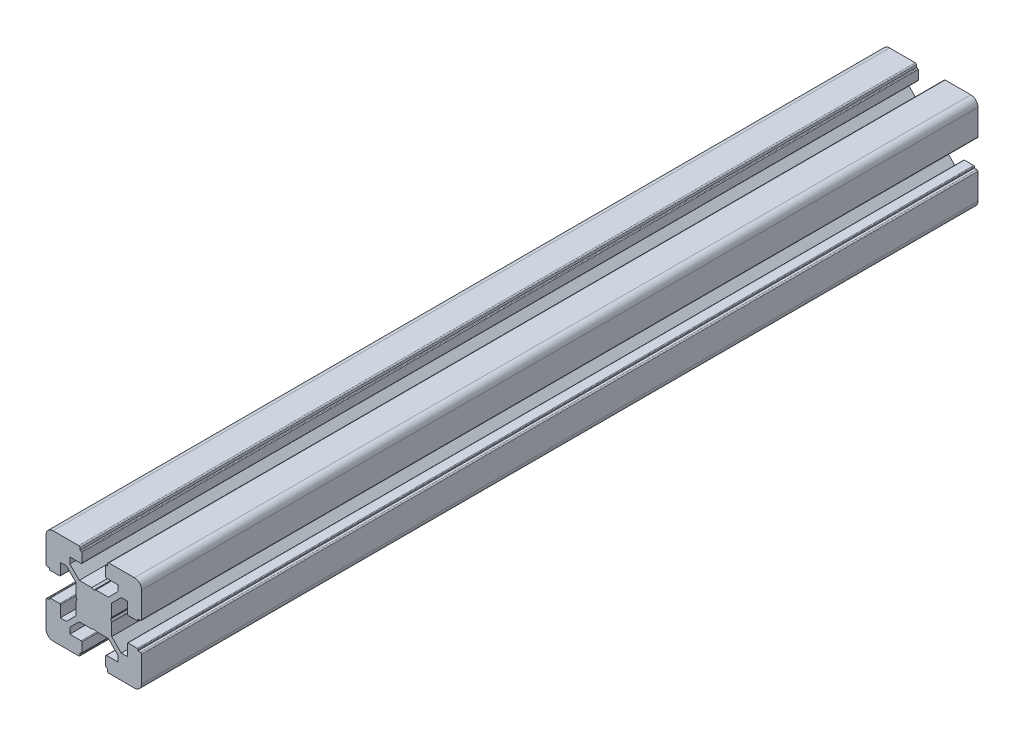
from build123d import *

# Parameters (mm, degrees)
BOSS_EXTRUDE1_DEPTH = 350


with BuildPart() as part:
    # Sketch2 → Boss-Extrude1 (new body)
    with BuildSketch(Plane.XY):
        with BuildLine():
            Line((-20.29996667, 9.949913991), (-20.29996667, 14.70003333))
            ThreePointArc((-20.29996667, 14.70003333), (-20.387834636, 14.912165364), (-20.59996667, 15.00003333))
            Line((-20.59996667, 15.00003333), (-24.49996667, 15.00003333))
            ThreePointArc((-24.49996667, 15.00003333), (-24.712098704, 14.912165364), (-24.79996667, 14.70003333))
            Line((-24.79996667, 14.70003333), (-24.79996667, 14.20003333))
            Line((-24.79996667, 14.20003333), (-25.79996667, 14.20003333))
            ThreePointArc((-25.79996667, 14.20003333), (-26.153520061, 14.053586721), (-26.29996667, 13.70003333))
            Line((-26.29996667, 13.70003333), (-26.29996667, 3))
            ThreePointArc((-26.29996667, 3), (-25.421287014, 0.878679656), (-23.29996667, 0))
            Line((-23.29996667, 0), (-12.6, 0))
            ThreePointArc((-12.6, 0), (-12.246446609, 0.146446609), (-12.1, 0.5))
            Line((-12.1, 0.5), (-12.1, 1.5))
            Line((-12.1, 1.5), (-11.6, 1.5))
            ThreePointArc((-11.6, 1.5), (-11.387867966, 1.587867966), (-11.3, 1.8))
            Line((-11.3, 1.8), (-11.3, 5.7))
            ThreePointArc((-11.3, 5.7), (-11.387867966, 5.912132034), (-11.6, 6))
            Line((-11.6, 6), (-16.350119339, 6))
            Line((-16.350119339, 6), (-16.350119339, 8.535633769))
            Line((-16.350119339, 8.535633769), (-12.385643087, 12.500110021))
            Line((-12.385643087, 12.500110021), (-7.165992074, 12.500110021))
            Line((-7.165992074, 12.500110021), (-6.29996667, 13.000110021))
            Line((-6.29996667, 13.000110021), (-5.433941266, 12.500110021))
            Line((-5.433941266, 12.500110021), (-0.214290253, 12.500110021))
            Line((-0.214290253, 12.500110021), (3.750119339, 8.535700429))
            Line((3.750119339, 8.535700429), (3.750119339, 6))
            Line((3.750119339, 6), (-1, 6))
            ThreePointArc((-1, 6), (-1.212132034, 5.912132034), (-1.3, 5.7))
            Line((-1.3, 5.7), (-1.3, 1.8))
            ThreePointArc((-1.3, 1.8), (-1.212132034, 1.587867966), (-1, 1.5))
            Line((-1, 1.5), (-0.5, 1.5))
            Line((-0.5, 1.5), (-0.5, 0.5))
            ThreePointArc((-0.5, 0.5), (-0.353553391, 0.146446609), (0, 0))
            Line((0, 0), (10.70003333, 0))
            ThreePointArc((10.70003333, 0), (12.821353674, 0.878679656), (13.70003333, 3))
            Line((13.70003333, 3), (13.70003333, 13.69996667))
            ThreePointArc((13.70003333, 13.69996667), (13.553586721, 14.053520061), (13.20003333, 14.19996667))
            Line((13.20003333, 14.19996667), (12.20003333, 14.19996667))
            Line((12.20003333, 14.19996667), (12.20003333, 14.69996667))
            ThreePointArc((12.20003333, 14.69996667), (12.112165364, 14.912098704), (11.90003333, 14.99996667))
            Line((11.90003333, 14.99996667), (8.00003333, 14.99996667))
            ThreePointArc((8.00003333, 14.99996667), (7.787901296, 14.912098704), (7.70003333, 14.69996667))
            Line((7.70003333, 14.69996667), (7.70003333, 9.949847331))
            Line((7.70003333, 9.949847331), (5.164399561, 9.949847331))
            Line((5.164399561, 9.949847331), (1.199923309, 13.914323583))
            Line((1.199923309, 13.914323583), (1.199923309, 19.133974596))
            Line((1.199923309, 19.133974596), (0.699923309, 20))
            Line((0.699923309, 20), (1.199923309, 20.866025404))
            Line((1.199923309, 20.866025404), (1.199923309, 26.085676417))
            Line((1.199923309, 26.085676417), (5.164332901, 30.050086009))
            Line((5.164332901, 30.050086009), (7.70003333, 30.050086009))
            Line((7.70003333, 30.050086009), (7.70003333, 25.29996667))
            ThreePointArc((7.70003333, 25.29996667), (7.787901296, 25.087834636), (8.00003333, 24.99996667))
            Line((8.00003333, 24.99996667), (11.90003333, 24.99996667))
            ThreePointArc((11.90003333, 24.99996667), (12.112165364, 25.087834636), (12.20003333, 25.29996667))
            Line((12.20003333, 25.29996667), (12.20003333, 25.79996667))
            Line((12.20003333, 25.79996667), (13.20003333, 25.79996667))
            ThreePointArc((13.20003333, 25.79996667), (13.553586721, 25.946413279), (13.70003333, 26.29996667))
            Line((13.70003333, 26.29996667), (13.70003333, 37))
            ThreePointArc((13.70003333, 37), (12.821353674, 39.121320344), (10.70003333, 40))
            Line((10.70003333, 40), (6.666e-05, 40))
            ThreePointArc((6.666e-05, 40), (-0.353486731, 39.853553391), (-0.49993334, 39.5))
            Line((-0.49993334, 39.5), (-0.49993334, 38.5))
            Line((-0.49993334, 38.5), (-0.99993334, 38.5))
            ThreePointArc((-0.99993334, 38.5), (-1.212065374, 38.412132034), (-1.29993334, 38.2))
            Line((-1.29993334, 38.2), (-1.29993334, 34.3))
            ThreePointArc((-1.29993334, 34.3), (-1.212065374, 34.087867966), (-0.99993334, 34))
            Line((-0.99993334, 34), (3.750185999, 34))
            Line((3.750185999, 34), (3.750185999, 31.464366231))
            Line((3.750185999, 31.464366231), (-0.214290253, 27.499889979))
            Line((-0.214290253, 27.499889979), (-5.433941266, 27.499889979))
            Line((-5.433941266, 27.499889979), (-6.29996667, 26.999889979))
            Line((-6.29996667, 26.999889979), (-7.165992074, 27.499889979))
            Line((-7.165992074, 27.499889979), (-12.385643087, 27.499889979))
            Line((-12.385643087, 27.499889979), (-16.350052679, 31.464299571))
            Line((-16.350052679, 31.464299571), (-16.350052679, 34))
            Line((-16.350052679, 34), (-11.59993334, 34))
            ThreePointArc((-11.59993334, 34), (-11.387801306, 34.087867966), (-11.29993334, 34.3))
            Line((-11.29993334, 34.3), (-11.29993334, 38.2))
            ThreePointArc((-11.29993334, 38.2), (-11.387801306, 38.412132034), (-11.59993334, 38.5))
            Line((-11.59993334, 38.5), (-12.09993334, 38.5))
            Line((-12.09993334, 38.5), (-12.09993334, 39.5))
            ThreePointArc((-12.09993334, 39.5), (-12.246379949, 39.853553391), (-12.59993334, 40))
            Line((-12.59993334, 40), (-23.29996667, 40))
            ThreePointArc((-23.29996667, 40), (-25.421287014, 39.121320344), (-26.29996667, 37))
            Line((-26.29996667, 37), (-26.29996667, 26.30003333))
            ThreePointArc((-26.29996667, 26.30003333), (-26.153520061, 25.946479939), (-25.79996667, 25.80003333))
            Line((-25.79996667, 25.80003333), (-24.79996667, 25.80003333))
            Line((-24.79996667, 25.80003333), (-24.79996667, 25.30003333))
            ThreePointArc((-24.79996667, 25.30003333), (-24.712098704, 25.087901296), (-24.49996667, 25.00003333))
            Line((-24.49996667, 25.00003333), (-20.59996667, 25.00003333))
            ThreePointArc((-20.59996667, 25.00003333), (-20.387834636, 25.087901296), (-20.29996667, 25.30003333))
            Line((-20.29996667, 25.30003333), (-20.29996667, 30.050152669))
            Line((-20.29996667, 30.050152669), (-17.764332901, 30.050152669))
            Line((-17.764332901, 30.050152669), (-13.799856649, 26.085676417))
            Line((-13.799856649, 26.085676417), (-13.799856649, 20.866025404))
            Line((-13.799856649, 20.866025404), (-13.299856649, 20))
            Line((-13.299856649, 20), (-13.799856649, 19.133974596))
            Line((-13.799856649, 19.133974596), (-13.799856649, 13.914323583))
            Line((-13.799856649, 13.914323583), (-17.764266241, 9.949913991))
            Line((-17.764266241, 9.949913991), (-20.29996667, 9.949913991))
        make_face()
    extrude(amount=BOSS_EXTRUDE1_DEPTH)


solid = part.part
